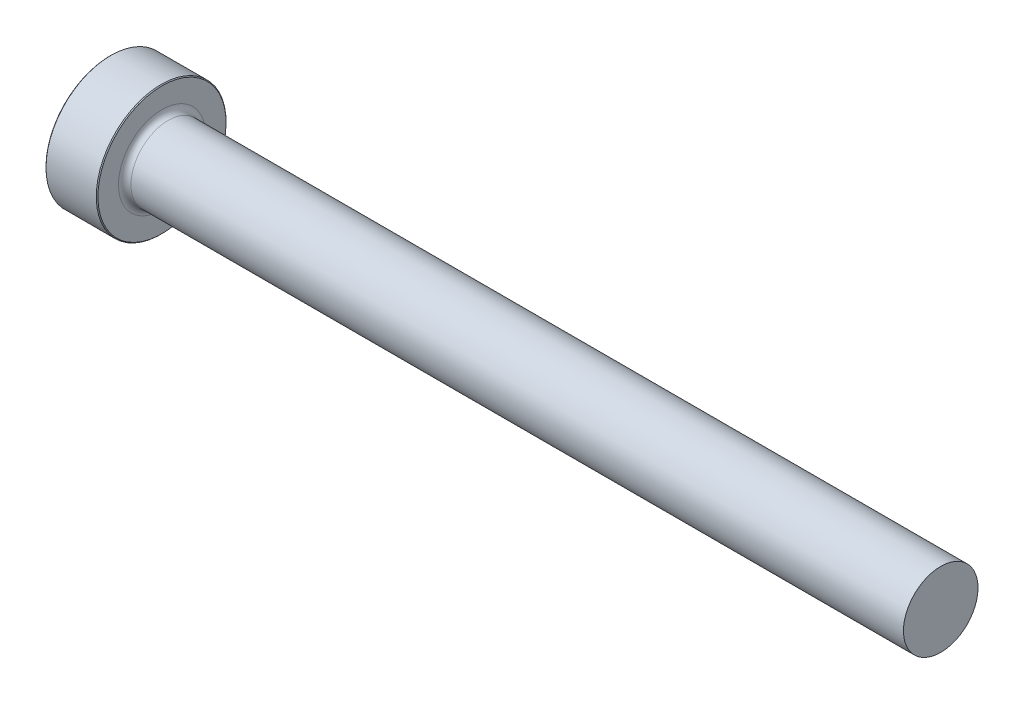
ISO-10303-21;
HEADER;
FILE_DESCRIPTION(('STEP AP214'),'2;1');
FILE_NAME('part.step','',(''),(''),'','','');
FILE_SCHEMA(('AUTOMOTIVE_DESIGN { 1 0 10303 214 1 1 1 1 }'));
ENDSEC;
DATA;
#1=APPLICATION_CONTEXT('core data for automotive mechanical design processes');
#2=APPLICATION_PROTOCOL_DEFINITION('international standard','automotive_design',2000,#1);
#3=PRODUCT_CONTEXT('',#1,'mechanical');
#4=PRODUCT('Part','Part','',(#3));
#5=PRODUCT_RELATED_PRODUCT_CATEGORY('part','',(#4));
#6=PRODUCT_DEFINITION_FORMATION('','',#4);
#7=PRODUCT_DEFINITION_CONTEXT('part definition',#1,'design');
#8=PRODUCT_DEFINITION('design','',#6,#7);
#9=PRODUCT_DEFINITION_SHAPE('','',#8);
#10=(LENGTH_UNIT() NAMED_UNIT(*) SI_UNIT(.MILLI.,.METRE.));
#11=(NAMED_UNIT(*) PLANE_ANGLE_UNIT() SI_UNIT($,.RADIAN.));
#12=(NAMED_UNIT(*) SI_UNIT($,.STERADIAN.) SOLID_ANGLE_UNIT());
#13=UNCERTAINTY_MEASURE_WITH_UNIT(LENGTH_MEASURE(1.E-05),#10,'distance_accuracy_value','');
#14=(GEOMETRIC_REPRESENTATION_CONTEXT(3) GLOBAL_UNCERTAINTY_ASSIGNED_CONTEXT((#13)) GLOBAL_UNIT_ASSIGNED_CONTEXT((#10,
#11,#12)) REPRESENTATION_CONTEXT('',''));
#15=CARTESIAN_POINT('',(0.,0.,0.));
#16=DIRECTION('',(0.,0.,1.));
#17=DIRECTION('',(1.,0.,0.));
#18=AXIS2_PLACEMENT_3D('',#15,#16,#17);
#19=CARTESIAN_POINT('',(101.6,4.56025249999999,0.));
#20=DIRECTION('',(1.,0.,0.));
#21=DIRECTION('',(0.,1.,0.));
#22=AXIS2_PLACEMENT_3D('',#19,#20,#21);
#23=PLANE('',#22);
#24=CARTESIAN_POINT('',(101.6,0.,0.));
#25=DIRECTION('',(1.,0.,0.));
#26=DIRECTION('',(0.,1.,0.));
#27=AXIS2_PLACEMENT_3D('',#24,#25,#26);
#28=CIRCLE('',#27,4.5602525);
#29=CARTESIAN_POINT('',(101.6,4.56025249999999,0.));
#30=VERTEX_POINT('',#29);
#31=EDGE_CURVE('E50',#30,#30,#28,.T.);
#32=ORIENTED_EDGE('',*,*,#31,.T.);
#33=EDGE_LOOP('',(#32));
#34=FACE_BOUND('',#33,.T.);
#35=ADVANCED_FACE('F30',(#34),#23,.T.);
#36=CARTESIAN_POINT('',(101.6,0.,0.));
#37=DIRECTION('',(1.,0.,0.));
#38=DIRECTION('',(0.,1.,0.));
#39=AXIS2_PLACEMENT_3D('',#36,#37,#38);
#40=CYLINDRICAL_SURFACE('',#39,4.5602525);
#41=CARTESIAN_POINT('',(7.11199999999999,0.,0.));
#42=DIRECTION('',(1.,0.,0.));
#43=DIRECTION('',(0.,1.,0.));
#44=AXIS2_PLACEMENT_3D('',#41,#42,#43);
#45=CIRCLE('',#44,4.56025249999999);
#46=CARTESIAN_POINT('',(7.11199999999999,4.56025249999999,0.));
#47=VERTEX_POINT('',#46);
#48=EDGE_CURVE('E53',#47,#47,#45,.T.);
#49=ORIENTED_EDGE('',*,*,#48,.T.);
#50=EDGE_LOOP('',(#49));
#51=FACE_BOUND('',#50,.T.);
#52=ORIENTED_EDGE('',*,*,#31,.F.);
#53=EDGE_LOOP('',(#52));
#54=FACE_BOUND('',#53,.T.);
#55=ADVANCED_FACE('F74',(#51,#54),#40,.T.);
#56=CARTESIAN_POINT('',(7.112,0.,0.));
#57=DIRECTION('',(1.,0.,0.));
#58=DIRECTION('',(0.,1.,0.));
#59=AXIS2_PLACEMENT_3D('',#56,#57,#58);
#60=TOROIDAL_SURFACE('',#59,5.32225249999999,0.762);
#61=CARTESIAN_POINT('',(6.34999999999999,0.,0.));
#62=DIRECTION('',(1.,0.,0.));
#63=DIRECTION('',(0.,1.,0.));
#64=AXIS2_PLACEMENT_3D('',#61,#62,#63);
#65=CIRCLE('',#64,5.32225249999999);
#66=CARTESIAN_POINT('',(6.34999999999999,5.32225249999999,0.));
#67=VERTEX_POINT('',#66);
#68=EDGE_CURVE('E56',#67,#67,#65,.T.);
#69=ORIENTED_EDGE('',*,*,#68,.T.);
#70=EDGE_LOOP('',(#69));
#71=FACE_BOUND('',#70,.T.);
#72=ORIENTED_EDGE('',*,*,#48,.F.);
#73=EDGE_LOOP('',(#72));
#74=FACE_BOUND('',#73,.T.);
#75=ADVANCED_FACE('F60',(#71,#74),#60,.F.);
#76=CARTESIAN_POINT('',(6.35,7.9375,0.));
#77=DIRECTION('',(1.,0.,0.));
#78=DIRECTION('',(0.,1.,0.));
#79=AXIS2_PLACEMENT_3D('',#76,#77,#78);
#80=PLANE('',#79);
#81=CARTESIAN_POINT('',(6.35,0.,0.));
#82=DIRECTION('',(1.,0.,0.));
#83=DIRECTION('',(0.,1.,0.));
#84=AXIS2_PLACEMENT_3D('',#81,#82,#83);
#85=CIRCLE('',#84,7.8359);
#86=CARTESIAN_POINT('',(6.35,7.8359,0.));
#87=VERTEX_POINT('',#86);
#88=EDGE_CURVE('E10',#87,#87,#85,.T.);
#89=ORIENTED_EDGE('',*,*,#88,.T.);
#90=EDGE_LOOP('',(#89));
#91=FACE_BOUND('',#90,.T.);
#92=ORIENTED_EDGE('',*,*,#68,.F.);
#93=EDGE_LOOP('',(#92));
#94=FACE_BOUND('',#93,.T.);
#95=ADVANCED_FACE('F63',(#91,#94),#80,.T.);
#96=CARTESIAN_POINT('',(101.6,0.,0.));
#97=DIRECTION('',(1.,0.,0.));
#98=DIRECTION('',(0.,1.,0.));
#99=AXIS2_PLACEMENT_3D('',#96,#97,#98);
#100=CYLINDRICAL_SURFACE('',#99,7.9375);
#101=CARTESIAN_POINT('',(0.101599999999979,0.,0.));
#102=DIRECTION('',(-1.,0.,0.));
#103=DIRECTION('',(0.,-1.,0.));
#104=AXIS2_PLACEMENT_3D('',#101,#102,#103);
#105=CIRCLE('',#104,7.9375);
#106=CARTESIAN_POINT('',(0.101599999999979,-7.9375,0.));
#107=VERTEX_POINT('',#106);
#108=EDGE_CURVE('E41',#107,#107,#105,.F.);
#109=ORIENTED_EDGE('',*,*,#108,.T.);
#110=EDGE_LOOP('',(#109));
#111=FACE_BOUND('',#110,.T.);
#112=CARTESIAN_POINT('',(6.2484,0.,0.));
#113=DIRECTION('',(1.,0.,0.));
#114=DIRECTION('',(0.,1.,0.));
#115=AXIS2_PLACEMENT_3D('',#112,#113,#114);
#116=CIRCLE('',#115,7.9375);
#117=CARTESIAN_POINT('',(6.2484,7.9375,0.));
#118=VERTEX_POINT('',#117);
#119=EDGE_CURVE('E45',#118,#118,#116,.F.);
#120=ORIENTED_EDGE('',*,*,#119,.T.);
#121=EDGE_LOOP('',(#120));
#122=FACE_BOUND('',#121,.T.);
#123=ADVANCED_FACE('F65',(#111,#122),#100,.T.);
#124=CARTESIAN_POINT('',(0.,0.,0.));
#125=DIRECTION('',(-1.,0.,0.));
#126=DIRECTION('',(0.,-1.,0.));
#127=AXIS2_PLACEMENT_3D('',#124,#125,#126);
#128=PLANE('',#127);
#129=CARTESIAN_POINT('',(0.,0.,0.));
#130=DIRECTION('',(-1.,0.,0.));
#131=DIRECTION('',(0.,-1.,0.));
#132=AXIS2_PLACEMENT_3D('',#129,#130,#131);
#133=CIRCLE('',#132,7.83590000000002);
#134=CARTESIAN_POINT('',(0.,-7.83590000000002,0.));
#135=VERTEX_POINT('',#134);
#136=EDGE_CURVE('E37',#135,#135,#133,.T.);
#137=ORIENTED_EDGE('',*,*,#136,.T.);
#138=EDGE_LOOP('',(#137));
#139=FACE_BOUND('',#138,.T.);
#140=ADVANCED_FACE('F71',(#139),#128,.T.);
#141=CARTESIAN_POINT('',(0.101599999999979,0.,0.));
#142=DIRECTION('',(1.,0.,0.));
#143=DIRECTION('',(0.,1.,0.));
#144=AXIS2_PLACEMENT_3D('',#141,#142,#143);
#145=CONICAL_SURFACE('',#144,7.9375,0.785398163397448);
#146=ORIENTED_EDGE('',*,*,#136,.F.);
#147=EDGE_LOOP('',(#146));
#148=FACE_BOUND('',#147,.T.);
#149=ORIENTED_EDGE('',*,*,#108,.F.);
#150=EDGE_LOOP('',(#149));
#151=FACE_BOUND('',#150,.T.);
#152=ADVANCED_FACE('F84',(#148,#151),#145,.T.);
#153=CARTESIAN_POINT('',(6.34999999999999,0.,0.));
#154=DIRECTION('',(-1.,0.,0.));
#155=DIRECTION('',(0.,-1.,0.));
#156=AXIS2_PLACEMENT_3D('',#153,#154,#155);
#157=CONICAL_SURFACE('',#156,7.83590000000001,0.785398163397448);
#158=ORIENTED_EDGE('',*,*,#119,.F.);
#159=EDGE_LOOP('',(#158));
#160=FACE_BOUND('',#159,.T.);
#161=ORIENTED_EDGE('',*,*,#88,.F.);
#162=EDGE_LOOP('',(#161));
#163=FACE_BOUND('',#162,.T.);
#164=ADVANCED_FACE('F32',(#160,#163),#157,.T.);
#165=CLOSED_SHELL('',(#35,#55,#75,#95,#123,#140,#152,#164));
#166=MANIFOLD_SOLID_BREP('B2',#165);
#167=ADVANCED_BREP_SHAPE_REPRESENTATION('',(#18,#166),#14);
#168=SHAPE_DEFINITION_REPRESENTATION(#9,#167);
ENDSEC;
END-ISO-10303-21;
